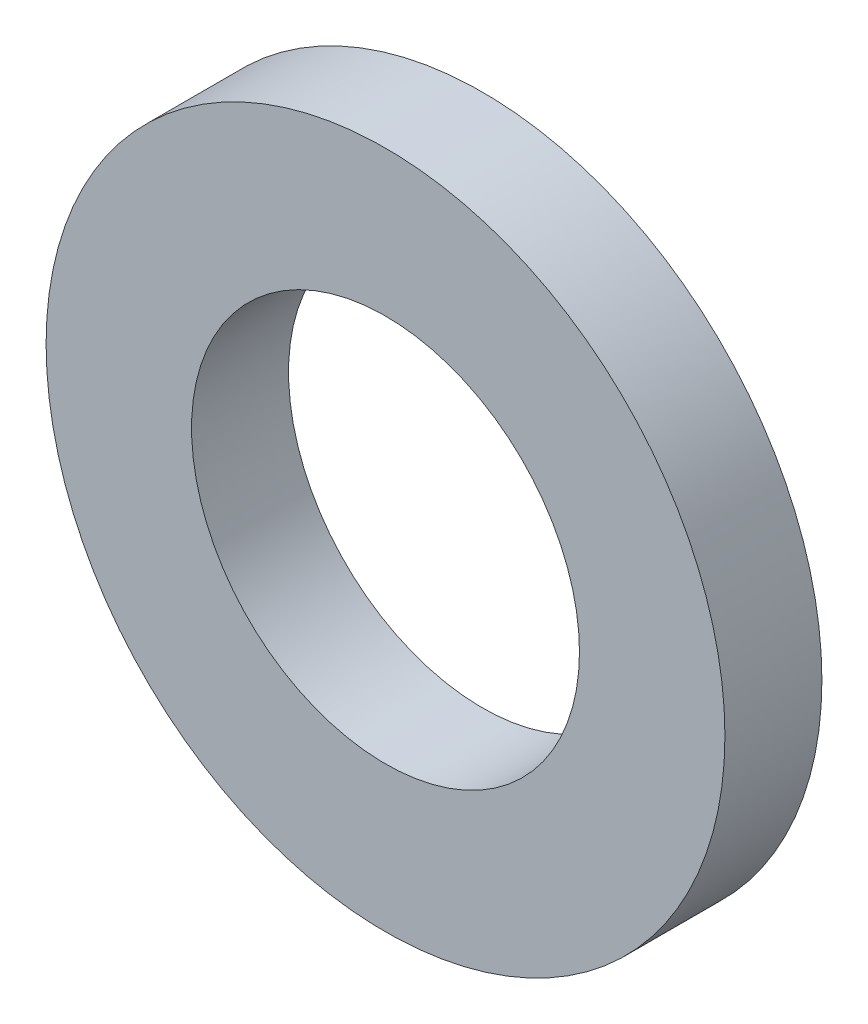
from build123d import *

# Parameters (mm, degrees)
SKETCH1_R      = 44.45
SKETCH1_R_2    = 25.4
EXTRUDE1_DEPTH = 6.35


with BuildPart() as part:
    # Sketch1 → Extrude1 (new, symmetric)
    with BuildSketch(Plane.XY):
        Circle(SKETCH1_R)
        Circle(SKETCH1_R_2, mode=Mode.SUBTRACT)
    extrude(amount=EXTRUDE1_DEPTH, both=True)


solid = part.part
